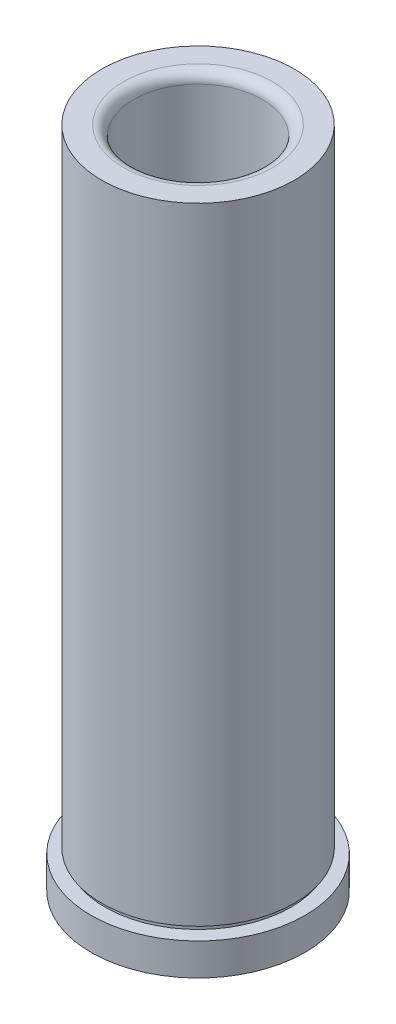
ISO-10303-21;
HEADER;
FILE_DESCRIPTION(('STEP AP214'),'2;1');
FILE_NAME('part.step','',(''),(''),'','','');
FILE_SCHEMA(('AUTOMOTIVE_DESIGN { 1 0 10303 214 1 1 1 1 }'));
ENDSEC;
DATA;
#1=APPLICATION_CONTEXT('core data for automotive mechanical design processes');
#2=APPLICATION_PROTOCOL_DEFINITION('international standard','automotive_design',2000,#1);
#3=PRODUCT_CONTEXT('',#1,'mechanical');
#4=PRODUCT('Part','Part','',(#3));
#5=PRODUCT_RELATED_PRODUCT_CATEGORY('part','',(#4));
#6=PRODUCT_DEFINITION_FORMATION('','',#4);
#7=PRODUCT_DEFINITION_CONTEXT('part definition',#1,'design');
#8=PRODUCT_DEFINITION('design','',#6,#7);
#9=PRODUCT_DEFINITION_SHAPE('','',#8);
#10=(LENGTH_UNIT() NAMED_UNIT(*) SI_UNIT(.MILLI.,.METRE.));
#11=(NAMED_UNIT(*) PLANE_ANGLE_UNIT() SI_UNIT($,.RADIAN.));
#12=(NAMED_UNIT(*) SI_UNIT($,.STERADIAN.) SOLID_ANGLE_UNIT());
#13=UNCERTAINTY_MEASURE_WITH_UNIT(LENGTH_MEASURE(1.E-05),#10,'distance_accuracy_value','');
#14=(GEOMETRIC_REPRESENTATION_CONTEXT(3) GLOBAL_UNCERTAINTY_ASSIGNED_CONTEXT((#13)) GLOBAL_UNIT_ASSIGNED_CONTEXT((#10,
#11,#12)) REPRESENTATION_CONTEXT('',''));
#15=CARTESIAN_POINT('',(0.,0.,0.));
#16=DIRECTION('',(0.,0.,1.));
#17=DIRECTION('',(1.,0.,0.));
#18=AXIS2_PLACEMENT_3D('',#15,#16,#17);
#19=CARTESIAN_POINT('',(-14.29385,98.4249999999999,0.));
#20=DIRECTION('',(0.,-1.,0.));
#21=DIRECTION('',(1.,0.,0.));
#22=AXIS2_PLACEMENT_3D('',#19,#20,#21);
#23=PLANE('',#22);
#24=CARTESIAN_POINT('',(-3.43649249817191E-13,98.425,0.));
#25=DIRECTION('',(0.,-1.,0.));
#26=DIRECTION('',(1.,0.,0.));
#27=AXIS2_PLACEMENT_3D('',#24,#25,#26);
#28=CIRCLE('',#27,11.0553499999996);
#29=CARTESIAN_POINT('',(11.0553499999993,98.425,0.));
#30=VERTEX_POINT('',#29);
#31=EDGE_CURVE('E36',#30,#30,#28,.T.);
#32=ORIENTED_EDGE('',*,*,#31,.T.);
#33=EDGE_LOOP('',(#32));
#34=FACE_BOUND('',#33,.T.);
#35=CARTESIAN_POINT('',(-3.43649249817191E-13,98.425,0.));
#36=DIRECTION('',(0.,-1.,0.));
#37=DIRECTION('',(1.,0.,0.));
#38=AXIS2_PLACEMENT_3D('',#35,#36,#37);
#39=CIRCLE('',#38,14.2938499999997);
#40=CARTESIAN_POINT('',(14.2938499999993,98.425,0.));
#41=VERTEX_POINT('',#40);
#42=EDGE_CURVE('E40',#41,#41,#39,.T.);
#43=ORIENTED_EDGE('',*,*,#42,.F.);
#44=EDGE_LOOP('',(#43));
#45=FACE_BOUND('',#44,.T.);
#46=ADVANCED_FACE('F29',(#34,#45),#23,.F.);
#47=CARTESIAN_POINT('',(3.49148336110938E-12,-1000.,0.));
#48=DIRECTION('',(0.,-1.,0.));
#49=DIRECTION('',(1.,0.,0.));
#50=AXIS2_PLACEMENT_3D('',#47,#48,#49);
#51=CYLINDRICAL_SURFACE('',#50,14.2938499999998);
#52=CARTESIAN_POINT('',(0.,5.52449999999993,0.));
#53=DIRECTION('',(0.,-1.,0.));
#54=DIRECTION('',(1.,0.,0.));
#55=AXIS2_PLACEMENT_3D('',#52,#53,#54);
#56=CIRCLE('',#55,14.29385);
#57=CARTESIAN_POINT('',(14.2938499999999,5.52449999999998,0.));
#58=VERTEX_POINT('',#57);
#59=EDGE_CURVE('E44',#58,#58,#56,.T.);
#60=ORIENTED_EDGE('',*,*,#59,.F.);
#61=EDGE_LOOP('',(#60));
#62=FACE_BOUND('',#61,.T.);
#63=ORIENTED_EDGE('',*,*,#42,.T.);
#64=EDGE_LOOP('',(#63));
#65=FACE_BOUND('',#64,.T.);
#66=ADVANCED_FACE('F121',(#62,#65),#51,.T.);
#67=CARTESIAN_POINT('',(-14.29385,5.52449999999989,0.));
#68=DIRECTION('',(0.,1.,0.));
#69=DIRECTION('',(-1.,0.,0.));
#70=AXIS2_PLACEMENT_3D('',#67,#68,#69);
#71=PLANE('',#70);
#72=CARTESIAN_POINT('',(0.,5.52449999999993,0.));
#73=DIRECTION('',(0.,-1.,0.));
#74=DIRECTION('',(1.,0.,0.));
#75=AXIS2_PLACEMENT_3D('',#72,#73,#74);
#76=CIRCLE('',#75,13.78585);
#77=CARTESIAN_POINT('',(13.7858499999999,5.52449999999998,0.));
#78=VERTEX_POINT('',#77);
#79=EDGE_CURVE('E49',#78,#78,#76,.T.);
#80=ORIENTED_EDGE('',*,*,#79,.F.);
#81=EDGE_LOOP('',(#80));
#82=FACE_BOUND('',#81,.T.);
#83=ORIENTED_EDGE('',*,*,#59,.T.);
#84=EDGE_LOOP('',(#83));
#85=FACE_BOUND('',#84,.T.);
#86=ADVANCED_FACE('F115',(#82,#85),#71,.F.);
#87=CARTESIAN_POINT('',(3.49148336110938E-12,-1000.,0.));
#88=DIRECTION('',(0.,-1.,0.));
#89=DIRECTION('',(1.,0.,0.));
#90=AXIS2_PLACEMENT_3D('',#87,#88,#89);
#91=CYLINDRICAL_SURFACE('',#90,13.78585);
#92=CARTESIAN_POINT('',(0.,4.7625,0.));
#93=DIRECTION('',(0.,-1.,0.));
#94=DIRECTION('',(1.,0.,0.));
#95=AXIS2_PLACEMENT_3D('',#92,#93,#94);
#96=CIRCLE('',#95,13.78585);
#97=CARTESIAN_POINT('',(13.78585,4.76250000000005,0.));
#98=VERTEX_POINT('',#97);
#99=EDGE_CURVE('E52',#98,#98,#96,.T.);
#100=ORIENTED_EDGE('',*,*,#99,.F.);
#101=EDGE_LOOP('',(#100));
#102=FACE_BOUND('',#101,.T.);
#103=ORIENTED_EDGE('',*,*,#79,.T.);
#104=EDGE_LOOP('',(#103));
#105=FACE_BOUND('',#104,.T.);
#106=ADVANCED_FACE('F109',(#102,#105),#91,.T.);
#107=CARTESIAN_POINT('',(-15.875,4.76249999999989,0.));
#108=DIRECTION('',(0.,-1.,0.));
#109=DIRECTION('',(1.,0.,0.));
#110=AXIS2_PLACEMENT_3D('',#107,#108,#109);
#111=PLANE('',#110);
#112=CARTESIAN_POINT('',(0.,4.7625,0.));
#113=DIRECTION('',(0.,-1.,0.));
#114=DIRECTION('',(1.,0.,0.));
#115=AXIS2_PLACEMENT_3D('',#112,#113,#114);
#116=CIRCLE('',#115,15.875);
#117=CARTESIAN_POINT('',(15.875,4.76250000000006,0.));
#118=VERTEX_POINT('',#117);
#119=EDGE_CURVE('E55',#118,#118,#116,.T.);
#120=ORIENTED_EDGE('',*,*,#119,.F.);
#121=EDGE_LOOP('',(#120));
#122=FACE_BOUND('',#121,.T.);
#123=ORIENTED_EDGE('',*,*,#99,.T.);
#124=EDGE_LOOP('',(#123));
#125=FACE_BOUND('',#124,.T.);
#126=ADVANCED_FACE('F103',(#122,#125),#111,.F.);
#127=CARTESIAN_POINT('',(3.49148336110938E-12,-1000.,0.));
#128=DIRECTION('',(0.,-1.,0.));
#129=DIRECTION('',(1.,0.,0.));
#130=AXIS2_PLACEMENT_3D('',#127,#128,#129);
#131=CYLINDRICAL_SURFACE('',#130,15.875);
#132=CARTESIAN_POINT('',(0.,-1.11022302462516E-13,0.));
#133=DIRECTION('',(0.,-1.,0.));
#134=DIRECTION('',(1.,0.,0.));
#135=AXIS2_PLACEMENT_3D('',#132,#133,#134);
#136=CIRCLE('',#135,15.875);
#137=CARTESIAN_POINT('',(15.875,0.,0.));
#138=VERTEX_POINT('',#137);
#139=EDGE_CURVE('E58',#138,#138,#136,.T.);
#140=ORIENTED_EDGE('',*,*,#139,.F.);
#141=EDGE_LOOP('',(#140));
#142=FACE_BOUND('',#141,.T.);
#143=ORIENTED_EDGE('',*,*,#119,.T.);
#144=EDGE_LOOP('',(#143));
#145=FACE_BOUND('',#144,.T.);
#146=ADVANCED_FACE('F97',(#142,#145),#131,.T.);
#147=CARTESIAN_POINT('',(-11.5950999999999,0.,0.));
#148=DIRECTION('',(0.,1.,0.));
#149=DIRECTION('',(-1.,0.,0.));
#150=AXIS2_PLACEMENT_3D('',#147,#148,#149);
#151=PLANE('',#150);
#152=CARTESIAN_POINT('',(0.,0.,0.));
#153=DIRECTION('',(0.,-1.,0.));
#154=DIRECTION('',(1.,0.,0.));
#155=AXIS2_PLACEMENT_3D('',#152,#153,#154);
#156=CIRCLE('',#155,11.5950999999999);
#157=CARTESIAN_POINT('',(11.5950999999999,0.,0.));
#158=VERTEX_POINT('',#157);
#159=EDGE_CURVE('E61',#158,#158,#156,.T.);
#160=ORIENTED_EDGE('',*,*,#159,.F.);
#161=EDGE_LOOP('',(#160));
#162=FACE_BOUND('',#161,.T.);
#163=ORIENTED_EDGE('',*,*,#139,.T.);
#164=EDGE_LOOP('',(#163));
#165=FACE_BOUND('',#164,.T.);
#166=ADVANCED_FACE('F91',(#162,#165),#151,.F.);
#167=CARTESIAN_POINT('',(0.,0.,0.));
#168=DIRECTION('',(0.,-1.,0.));
#169=DIRECTION('',(1.,0.,0.));
#170=AXIS2_PLACEMENT_3D('',#167,#168,#169);
#171=CONICAL_SURFACE('',#170,11.5950999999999,0.785398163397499);
#172=CARTESIAN_POINT('',(0.,0.793749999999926,0.));
#173=DIRECTION('',(0.,-1.,0.));
#174=DIRECTION('',(1.,0.,0.));
#175=AXIS2_PLACEMENT_3D('',#172,#173,#174);
#176=CIRCLE('',#175,10.8013499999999);
#177=CARTESIAN_POINT('',(10.8013499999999,0.793749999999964,0.));
#178=VERTEX_POINT('',#177);
#179=EDGE_CURVE('E64',#178,#178,#176,.T.);
#180=ORIENTED_EDGE('',*,*,#179,.F.);
#181=EDGE_LOOP('',(#180));
#182=FACE_BOUND('',#181,.T.);
#183=ORIENTED_EDGE('',*,*,#159,.T.);
#184=EDGE_LOOP('',(#183));
#185=FACE_BOUND('',#184,.T.);
#186=ADVANCED_FACE('F85',(#182,#185),#171,.F.);
#187=CARTESIAN_POINT('',(3.49148336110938E-12,-1000.,0.));
#188=DIRECTION('',(0.,-1.,0.));
#189=DIRECTION('',(1.,0.,0.));
#190=AXIS2_PLACEMENT_3D('',#187,#188,#189);
#191=CYLINDRICAL_SURFACE('',#190,10.8013499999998);
#192=CARTESIAN_POINT('',(-2.06189549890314E-13,59.0549999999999,0.));
#193=DIRECTION('',(0.,-1.,0.));
#194=DIRECTION('',(1.,0.,0.));
#195=AXIS2_PLACEMENT_3D('',#192,#193,#194);
#196=CIRCLE('',#195,10.8013499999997);
#197=CARTESIAN_POINT('',(10.8013499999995,59.0549999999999,0.));
#198=VERTEX_POINT('',#197);
#199=EDGE_CURVE('E67',#198,#198,#196,.T.);
#200=ORIENTED_EDGE('',*,*,#199,.F.);
#201=EDGE_LOOP('',(#200));
#202=FACE_BOUND('',#201,.T.);
#203=ORIENTED_EDGE('',*,*,#179,.T.);
#204=EDGE_LOOP('',(#203));
#205=FACE_BOUND('',#204,.T.);
#206=ADVANCED_FACE('F79',(#202,#205),#191,.F.);
#207=CARTESIAN_POINT('',(-2.0643209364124E-13,59.055,0.));
#208=DIRECTION('',(0.,-1.,0.));
#209=DIRECTION('',(1.,0.,0.));
#210=AXIS2_PLACEMENT_3D('',#207,#208,#209);
#211=TOROIDAL_SURFACE('',#210,9.53134999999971,1.27000000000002);
#212=CARTESIAN_POINT('',(-2.10623733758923E-13,60.325,0.));
#213=DIRECTION('',(0.,-1.,0.));
#214=DIRECTION('',(1.,0.,0.));
#215=AXIS2_PLACEMENT_3D('',#212,#213,#214);
#216=CIRCLE('',#215,9.5313499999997);
#217=CARTESIAN_POINT('',(9.5313499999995,60.325,0.));
#218=VERTEX_POINT('',#217);
#219=EDGE_CURVE('E70',#218,#218,#216,.T.);
#220=ORIENTED_EDGE('',*,*,#219,.F.);
#221=EDGE_LOOP('',(#220));
#222=FACE_BOUND('',#221,.T.);
#223=ORIENTED_EDGE('',*,*,#199,.T.);
#224=EDGE_LOOP('',(#223));
#225=FACE_BOUND('',#224,.T.);
#226=ADVANCED_FACE('F76',(#222,#225),#211,.F.);
#227=CARTESIAN_POINT('',(3.49148336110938E-12,-1000.,0.));
#228=DIRECTION('',(0.,-1.,0.));
#229=DIRECTION('',(1.,0.,0.));
#230=AXIS2_PLACEMENT_3D('',#227,#228,#229);
#231=CYLINDRICAL_SURFACE('',#230,9.53134999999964);
#232=CARTESIAN_POINT('',(-3.3832822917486E-13,96.9009999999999,0.));
#233=DIRECTION('',(0.,-1.,0.));
#234=DIRECTION('',(1.,0.,0.));
#235=AXIS2_PLACEMENT_3D('',#232,#233,#234);
#236=CIRCLE('',#235,9.53134999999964);
#237=CARTESIAN_POINT('',(9.5313499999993,96.9009999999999,0.));
#238=VERTEX_POINT('',#237);
#239=EDGE_CURVE('E10',#238,#238,#236,.F.);
#240=ORIENTED_EDGE('',*,*,#239,.T.);
#241=EDGE_LOOP('',(#240));
#242=FACE_BOUND('',#241,.T.);
#243=ORIENTED_EDGE('',*,*,#219,.T.);
#244=EDGE_LOOP('',(#243));
#245=FACE_BOUND('',#244,.T.);
#246=ADVANCED_FACE('F74',(#242,#245),#231,.F.);
#247=CARTESIAN_POINT('',(-3.3832822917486E-13,96.9009999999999,0.));
#248=DIRECTION('',(0.,-1.,0.));
#249=DIRECTION('',(1.,0.,0.));
#250=AXIS2_PLACEMENT_3D('',#247,#248,#249);
#251=TOROIDAL_SURFACE('',#250,11.0553499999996,1.524);
#252=ORIENTED_EDGE('',*,*,#239,.F.);
#253=EDGE_LOOP('',(#252));
#254=FACE_BOUND('',#253,.T.);
#255=ORIENTED_EDGE('',*,*,#31,.F.);
#256=EDGE_LOOP('',(#255));
#257=FACE_BOUND('',#256,.T.);
#258=ADVANCED_FACE('F31',(#254,#257),#251,.T.);
#259=CLOSED_SHELL('',(#46,#66,#86,#106,#126,#146,#166,#186,#206,#226,#246,#258));
#260=MANIFOLD_SOLID_BREP('B2',#259);
#261=ADVANCED_BREP_SHAPE_REPRESENTATION('',(#18,#260),#14);
#262=SHAPE_DEFINITION_REPRESENTATION(#9,#261);
ENDSEC;
END-ISO-10303-21;
